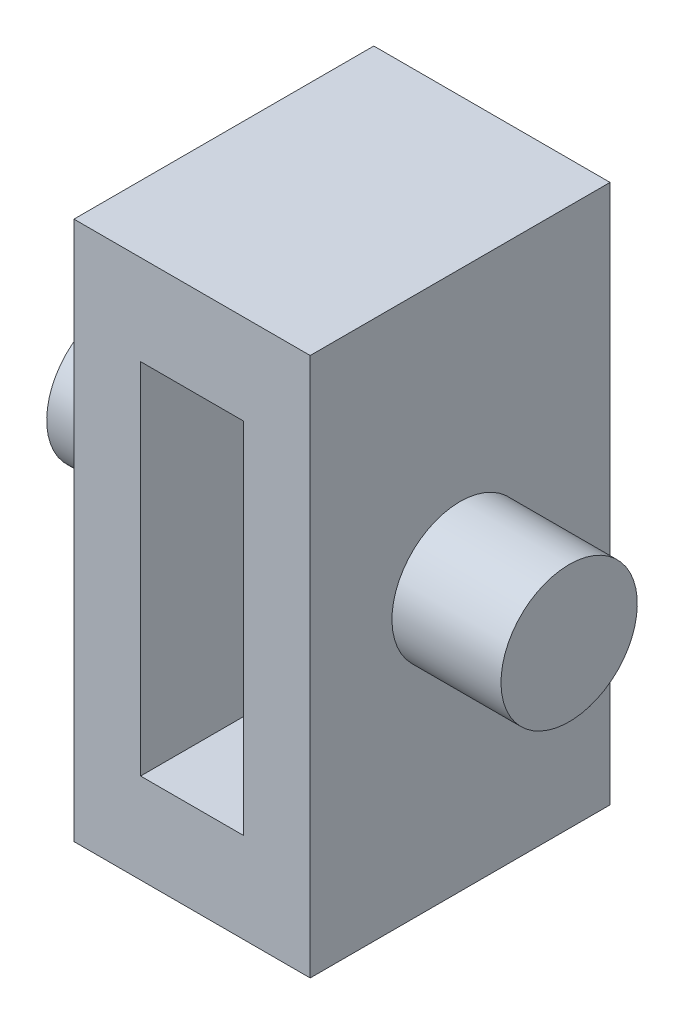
from build123d import *

# Parameters (mm, degrees)
SKETCH2_W           = 7.8
SKETCH2_H           = 17.8
BOSS_EXTRUDE1_DEPTH = 9.9
SKETCH3_W           = 3.4
SKETCH3_H           = 11.85
CUT_EXTRUDE1_DEPTH  = 9.9
SKETCH5_R           = 2.25
BOSS_EXTRUDE2_DEPTH = 3.6
BOSS_EXTRUDE3_START = 3.6
SKETCH6_R           = 2.25
BOSS_EXTRUDE3_DEPTH = 3.6


with BuildPart() as part:
    # Sketch2 → Boss-Extrude1 (new body)
    with BuildSketch(Plane.XY):
        with Locations((3.852048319, 8.842226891)):
            Rectangle(SKETCH2_W, SKETCH2_H)
    extrude(amount=BOSS_EXTRUDE1_DEPTH)

    # Sketch3 → Cut-Extrude1 (cut)
    with BuildSketch(Plane.XY.offset(9.9)):
        with Locations((3.852048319, 8.842226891)):
            Rectangle(SKETCH3_W, SKETCH3_H)
    extrude(amount=-CUT_EXTRUDE1_DEPTH, mode=Mode.SUBTRACT)

    # Sketch5 → Boss-Extrude2 (add)
    with BuildSketch(Plane(origin=(7.752048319, 0, 0), x_dir=(0, 0, -1), z_dir=(1, 0, 0))):
        with Locations(Location((-4.95, 8.842226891, 0), (0, 0, 90))):
            Circle(SKETCH5_R)
    extrude(amount=BOSS_EXTRUDE2_DEPTH)

    # Sketch6 → Boss-Extrude3 (add)
    with BuildSketch(Plane.ZY.offset(0.047951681).offset(BOSS_EXTRUDE3_START)):
        with Locations(Location((4.95, 8.842226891, 0), (0, 0, 90))):
            Circle(SKETCH6_R)
    extrude(amount=-BOSS_EXTRUDE3_DEPTH)


solid = part.part
